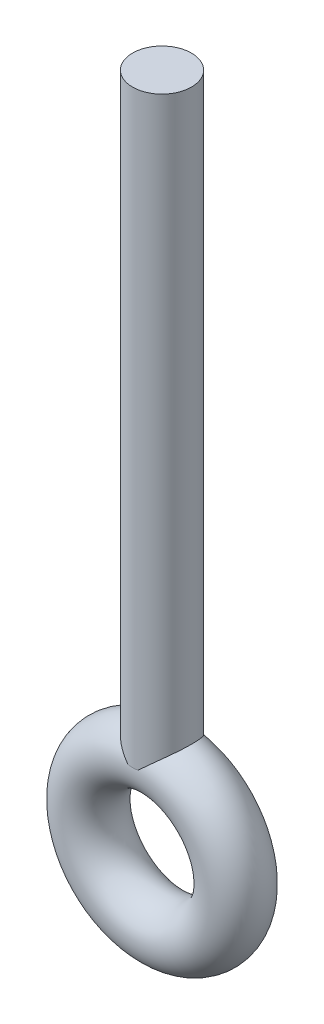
ISO-10303-21;
HEADER;
FILE_DESCRIPTION(('STEP AP214'),'2;1');
FILE_NAME('part.step','',(''),(''),'','','');
FILE_SCHEMA(('AUTOMOTIVE_DESIGN { 1 0 10303 214 1 1 1 1 }'));
ENDSEC;
DATA;
#1=APPLICATION_CONTEXT('core data for automotive mechanical design processes');
#2=APPLICATION_PROTOCOL_DEFINITION('international standard','automotive_design',2000,#1);
#3=PRODUCT_CONTEXT('',#1,'mechanical');
#4=PRODUCT('Part','Part','',(#3));
#5=PRODUCT_RELATED_PRODUCT_CATEGORY('part','',(#4));
#6=PRODUCT_DEFINITION_FORMATION('','',#4);
#7=PRODUCT_DEFINITION_CONTEXT('part definition',#1,'design');
#8=PRODUCT_DEFINITION('design','',#6,#7);
#9=PRODUCT_DEFINITION_SHAPE('','',#8);
#10=(LENGTH_UNIT() NAMED_UNIT(*) SI_UNIT(.MILLI.,.METRE.));
#11=(NAMED_UNIT(*) PLANE_ANGLE_UNIT() SI_UNIT($,.RADIAN.));
#12=(NAMED_UNIT(*) SI_UNIT($,.STERADIAN.) SOLID_ANGLE_UNIT());
#13=UNCERTAINTY_MEASURE_WITH_UNIT(LENGTH_MEASURE(1.E-05),#10,'distance_accuracy_value','');
#14=(GEOMETRIC_REPRESENTATION_CONTEXT(3) GLOBAL_UNCERTAINTY_ASSIGNED_CONTEXT((#13)) GLOBAL_UNIT_ASSIGNED_CONTEXT((#10,
#11,#12)) REPRESENTATION_CONTEXT('',''));
#15=CARTESIAN_POINT('',(0.,0.,0.));
#16=DIRECTION('',(0.,0.,1.));
#17=DIRECTION('',(1.,0.,0.));
#18=AXIS2_PLACEMENT_3D('',#15,#16,#17);
#19=CARTESIAN_POINT('',(0.,8.,0.));
#20=DIRECTION('',(0.,1.,0.));
#21=DIRECTION('',(0.,0.,1.));
#22=AXIS2_PLACEMENT_3D('',#19,#20,#21);
#23=PLANE('',#22);
#24=CARTESIAN_POINT('',(0.,8.,2.95803989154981));
#25=CARTESIAN_POINT('',(-0.247460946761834,8.,2.95804711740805));
#26=CARTESIAN_POINT('',(-0.49492265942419,8.,2.95616386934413));
#27=CARTESIAN_POINT('',(-0.989773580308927,8.,2.94788561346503));
#28=CARTESIAN_POINT('',(-1.23716279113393,8.,2.94149079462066));
#29=CARTESIAN_POINT('',(-1.60776807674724,8.,2.92679903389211));
#30=CARTESIAN_POINT('',(-1.731082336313,8.,2.92106134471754));
#31=CARTESIAN_POINT('',(-1.97758381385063,8.,2.90746047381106));
#32=CARTESIAN_POINT('',(-2.10077103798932,8.,2.89959740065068));
#33=CARTESIAN_POINT('',(-2.46998876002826,8.,2.87212468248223));
#34=CARTESIAN_POINT('',(-2.71577107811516,8.,2.84862845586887));
#35=CARTESIAN_POINT('',(-3.12136668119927,8.,2.79714191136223));
#36=CARTESIAN_POINT('',(-3.28172002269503,8.,2.77346517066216));
#37=CARTESIAN_POINT('',(-3.60098801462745,8.,2.71792496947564));
#38=CARTESIAN_POINT('',(-3.75990307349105,8.,2.68606391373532));
#39=CARTESIAN_POINT('',(-4.07526568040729,8.,2.61236064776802));
#40=CARTESIAN_POINT('',(-4.23171575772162,8.,2.57052948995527));
#41=CARTESIAN_POINT('',(-4.54085538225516,8.,2.47487456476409));
#42=CARTESIAN_POINT('',(-4.69354717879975,8.,2.42105817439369));
#43=CARTESIAN_POINT('',(-5.02114932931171,8.,2.28793160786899));
#44=CARTESIAN_POINT('',(-5.19492044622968,8.,2.20574311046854));
#45=CARTESIAN_POINT('',(-5.52939647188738,8.,2.01780762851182));
#46=CARTESIAN_POINT('',(-5.69011477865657,8.,1.91208522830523));
#47=CARTESIAN_POINT('',(-5.95753271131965,8.,1.70059309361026));
#48=CARTESIAN_POINT('',(-6.06831082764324,8.,1.60002476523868));
#49=CARTESIAN_POINT('',(-6.27238605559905,8.,1.38240612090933));
#50=CARTESIAN_POINT('',(-6.36570690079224,8.,1.26537856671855));
#51=CARTESIAN_POINT('',(-6.51329983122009,8.,1.04010634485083));
#52=CARTESIAN_POINT('',(-6.57163288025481,8.,0.934533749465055));
#53=CARTESIAN_POINT('',(-6.67002120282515,8.,0.715134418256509));
#54=CARTESIAN_POINT('',(-6.71008623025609,8.,0.601312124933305));
#55=CARTESIAN_POINT('',(-6.7694642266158,8.,0.367665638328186));
#56=CARTESIAN_POINT('',(-6.78866633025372,8.,0.247812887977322));
#57=CARTESIAN_POINT('',(-6.80446971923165,8.,0.00662180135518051));
#58=CARTESIAN_POINT('',(-6.80107644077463,8.,-0.114716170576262));
#59=CARTESIAN_POINT('',(-6.77326925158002,8.,-0.344084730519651));
#60=CARTESIAN_POINT('',(-6.75072472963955,8.,-0.452349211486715));
#61=CARTESIAN_POINT('',(-6.68849017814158,8.,-0.663777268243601));
#62=CARTESIAN_POINT('',(-6.64880041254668,8.,-0.766940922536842));
#63=CARTESIAN_POINT('',(-6.55241367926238,8.,-0.970289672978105));
#64=CARTESIAN_POINT('',(-6.49506970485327,8.,-1.07016536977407));
#65=CARTESIAN_POINT('',(-6.36682471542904,8.,-1.26077000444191));
#66=CARTESIAN_POINT('',(-6.29591319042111,8.,-1.35149176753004));
#67=CARTESIAN_POINT('',(-6.10249444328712,8.,-1.5689667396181));
#68=CARTESIAN_POINT('',(-5.97262185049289,8.,-1.68917707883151));
#69=CARTESIAN_POINT('',(-5.69547750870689,8.,-1.90730054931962));
#70=CARTESIAN_POINT('',(-5.54817808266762,8.,-2.00517746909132));
#71=CARTESIAN_POINT('',(-5.27463351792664,8.,-2.16223273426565));
#72=CARTESIAN_POINT('',(-5.1505221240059,8.,-2.22521772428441));
#73=CARTESIAN_POINT('',(-4.89720959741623,8.,-2.34010688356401));
#74=CARTESIAN_POINT('',(-4.76800491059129,8.,-2.39200314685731));
#75=CARTESIAN_POINT('',(-4.50575508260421,8.,-2.48618961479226));
#76=CARTESIAN_POINT('',(-4.37269965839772,8.,-2.52845077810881));
#77=CARTESIAN_POINT('',(-4.10430734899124,8.,-2.60450190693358));
#78=CARTESIAN_POINT('',(-3.96897180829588,8.,-2.6382966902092));
#79=CARTESIAN_POINT('',(-3.60023653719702,8.,-2.72014870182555));
#80=CARTESIAN_POINT('',(-3.36532021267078,8.,-2.76133707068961));
#81=CARTESIAN_POINT('',(-2.89325855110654,8.,-2.82842060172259));
#82=CARTESIAN_POINT('',(-2.65611139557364,8.,-2.85430194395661));
#83=CARTESIAN_POINT('',(-2.18011166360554,8.,-2.89539352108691));
#84=CARTESIAN_POINT('',(-1.94125602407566,8.,-2.91056627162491));
#85=CARTESIAN_POINT('',(-1.46330724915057,8.,-2.93368425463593));
#86=CARTESIAN_POINT('',(-1.22421421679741,8.,-2.94163184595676));
#87=CARTESIAN_POINT('',(-0.743847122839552,8.,-2.9527968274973));
#88=CARTESIAN_POINT('',(-0.502572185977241,8.,-2.95597245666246));
#89=CARTESIAN_POINT('',(-0.0199792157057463,8.,-2.95865902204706));
#90=CARTESIAN_POINT('',(0.221338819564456,8.,-2.95816957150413));
#91=CARTESIAN_POINT('',(0.70344713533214,8.,-2.95333444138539));
#92=CARTESIAN_POINT('',(0.944237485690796,8.,-2.94899665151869));
#93=CARTESIAN_POINT('',(1.42564383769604,8.,-2.93491469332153));
#94=CARTESIAN_POINT('',(1.66625985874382,8.,-2.92517126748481));
#95=CARTESIAN_POINT('',(2.14569930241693,8.,-2.89752531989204));
#96=CARTESIAN_POINT('',(2.38452518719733,8.,-2.8796690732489));
#97=CARTESIAN_POINT('',(2.86124761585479,8.,-2.83187784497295));
#98=CARTESIAN_POINT('',(3.09914322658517,8.,-2.80193287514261));
#99=CARTESIAN_POINT('',(3.56967012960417,8.,-2.72542663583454));
#100=CARTESIAN_POINT('',(3.8023305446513,8.,-2.67905220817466));
#101=CARTESIAN_POINT('',(4.26192487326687,8.,-2.56393752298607));
#102=CARTESIAN_POINT('',(4.48886813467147,8.,-2.49523672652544));
#103=CARTESIAN_POINT('',(4.86544771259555,8.,-2.35392675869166));
#104=CARTESIAN_POINT('',(5.01782302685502,8.,-2.2886947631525));
#105=CARTESIAN_POINT('',(5.31488130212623,8.,-2.14151619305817));
#106=CARTESIAN_POINT('',(5.45954577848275,8.,-2.05953154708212));
#107=CARTESIAN_POINT('',(5.73784718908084,8.,-1.8759752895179));
#108=CARTESIAN_POINT('',(5.87138064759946,8.,-1.77424407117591));
#109=CARTESIAN_POINT('',(6.11992064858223,8.,-1.55023382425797));
#110=CARTESIAN_POINT('',(6.23496748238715,8.,-1.42800070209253));
#111=CARTESIAN_POINT('',(6.41264946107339,8.,-1.19761963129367));
#112=CARTESIAN_POINT('',(6.4811444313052,8.,-1.09400485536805));
#113=CARTESIAN_POINT('',(6.60039535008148,8.,-0.87693884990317));
#114=CARTESIAN_POINT('',(6.65115958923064,8.,-0.76349224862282));
#115=CARTESIAN_POINT('',(6.73197157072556,8.,-0.528491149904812));
#116=CARTESIAN_POINT('',(6.76187746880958,8.,-0.406887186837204));
#117=CARTESIAN_POINT('',(6.79808596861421,8.,-0.160207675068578));
#118=CARTESIAN_POINT('',(6.80440053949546,8.,-0.0351339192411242));
#119=CARTESIAN_POINT('',(6.79356008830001,8.,0.200775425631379));
#120=CARTESIAN_POINT('',(6.77879605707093,8.,0.311729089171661));
#121=CARTESIAN_POINT('',(6.73097486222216,8.,0.529580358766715));
#122=CARTESIAN_POINT('',(6.69791817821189,8.,0.636478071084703));
#123=CARTESIAN_POINT('',(6.6150792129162,8.,0.844632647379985));
#124=CARTESIAN_POINT('',(6.56514823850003,8.,0.945829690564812));
#125=CARTESIAN_POINT('',(6.45116096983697,8.,1.13988097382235));
#126=CARTESIAN_POINT('',(6.38709704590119,8.,1.23273066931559));
#127=CARTESIAN_POINT('',(6.21446603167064,8.,1.45085834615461));
#128=CARTESIAN_POINT('',(6.09915290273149,8.,1.57080194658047));
#129=CARTESIAN_POINT('',(5.85077918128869,8.,1.79061235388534));
#130=CARTESIAN_POINT('',(5.71768391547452,8.,1.89043895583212));
#131=CARTESIAN_POINT('',(5.47280767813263,8.,2.04974334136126));
#132=CARTESIAN_POINT('',(5.36353175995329,8.,2.11316288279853));
#133=CARTESIAN_POINT('',(5.13979135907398,8.,2.23018643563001));
#134=CARTESIAN_POINT('',(5.02532374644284,8.,2.28378442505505));
#135=CARTESIAN_POINT('',(4.79250469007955,8.,2.38222673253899));
#136=CARTESIAN_POINT('',(4.67414714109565,8.,2.42705643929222));
#137=CARTESIAN_POINT('',(4.43483223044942,8.,2.50888202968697));
#138=CARTESIAN_POINT('',(4.31387580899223,8.,2.54588069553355));
#139=CARTESIAN_POINT('',(4.02321226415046,8.,2.62599579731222));
#140=CARTESIAN_POINT('',(3.8526491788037,8.,2.66599136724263));
#141=CARTESIAN_POINT('',(3.50934978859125,8.,2.73539836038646));
#142=CARTESIAN_POINT('',(3.33661230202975,8.,2.76480374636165));
#143=CARTESIAN_POINT('',(2.98953899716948,8.,2.81524361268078));
#144=CARTESIAN_POINT('',(2.81520039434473,8.,2.83625844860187));
#145=CARTESIAN_POINT('',(2.46591102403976,8.,2.8717230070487));
#146=CARTESIAN_POINT('',(2.29096036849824,8.,2.88617387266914));
#147=CARTESIAN_POINT('',(1.93972593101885,8.,2.91019183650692));
#148=CARTESIAN_POINT('',(1.76344027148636,8.,2.91973034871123));
#149=CARTESIAN_POINT('',(1.41071151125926,8.,2.93510926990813));
#150=CARTESIAN_POINT('',(1.23426840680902,8.,2.94094958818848));
#151=CARTESIAN_POINT('',(0.881533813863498,8.,2.94989268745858));
#152=CARTESIAN_POINT('',(0.705242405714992,8.,2.9529988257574));
#153=CARTESIAN_POINT('',(0.352634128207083,8.,2.95706986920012));
#154=CARTESIAN_POINT('',(0.176317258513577,8.,2.95803474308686));
#155=CARTESIAN_POINT('',(0.,8.,2.95803989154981));
#156=B_SPLINE_CURVE_WITH_KNOTS('',3,(#24,#25,#26,#27,#28,#29,#30,#31,#32,#33,#34,#35,#36,#37,
#38,#39,#40,#41,#42,#43,#44,#45,#46,#47,#48,#49,#50,#51,#52,#53,#54,#55,#56,#57,#58,#59,#60,#61,
#62,#63,#64,#65,#66,#67,#68,#69,#70,#71,#72,#73,#74,#75,#76,#77,#78,#79,#80,#81,#82,#83,#84,#85,
#86,#87,#88,#89,#90,#91,#92,#93,#94,#95,#96,#97,#98,#99,#100,#101,#102,#103,#104,#105,#106,#107,
#108,#109,#110,#111,#112,#113,#114,#115,#116,#117,#118,#119,#120,#121,#122,#123,#124,#125,#126,
#127,#128,#129,#130,#131,#132,#133,#134,#135,#136,#137,#138,#139,#140,#141,#142,#143,#144,#145,
#146,#147,#148,#149,#150,#151,#152,#153,#154,#155),.UNSPECIFIED.,.T.,.F.,(4,2,2,2,2,2,2,2,2,2,2,
2,2,2,2,2,2,2,2,2,2,2,2,2,2,2,2,2,2,2,2,2,2,2,2,2,2,2,2,2,2,2,2,2,2,2,2,2,2,2,2,2,2,2,2,2,2,2,2,
2,2,2,2,2,2,4),(0.,0.742377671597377,1.48472424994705,1.85504950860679,2.22535585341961,
2.96568123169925,3.45179511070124,3.93776632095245,4.42320129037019,4.90833829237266,
5.48356135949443,6.05818632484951,6.50548354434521,6.95216816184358,7.31254439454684,
7.67272798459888,8.03481636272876,8.39681762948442,8.72707505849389,9.05732740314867,
9.40151600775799,9.7459723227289,10.2738794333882,10.8026365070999,11.2195910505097,
11.6368418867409,12.0553342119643,12.4735878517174,13.1882955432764,13.9036475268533,
14.621491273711,15.3391005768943,16.0629540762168,16.7868839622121,17.5093330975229,
18.2316830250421,18.9499634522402,19.668838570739,20.3797877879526,21.0894872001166,
21.5859374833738,22.0835287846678,22.5853233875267,23.0860090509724,23.457203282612,
23.8282237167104,24.2017432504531,24.5750732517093,24.9092659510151,25.2434498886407,
25.5806588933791,25.9180503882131,26.4144159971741,26.911763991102,27.2902853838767,
27.6690380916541,28.0484166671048,28.427660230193,28.9527782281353,29.4781951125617,
30.0048350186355,30.5313831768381,31.0609617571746,31.590553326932,32.1194936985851,
32.6484417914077),.UNSPECIFIED.);
#157=CARTESIAN_POINT('',(-0.516666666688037,8.,-2.95517436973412));
#158=VERTEX_POINT('',#157);
#159=CARTESIAN_POINT('',(0.516666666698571,8.,-2.95517436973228));
#160=VERTEX_POINT('',#159);
#161=EDGE_CURVE('E11',#158,#160,#156,.T.);
#162=ORIENTED_EDGE('',*,*,#161,.F.);
#163=CARTESIAN_POINT('',(0.,8.,0.));
#164=DIRECTION('',(0.,1.,0.));
#165=DIRECTION('',(0.,0.,1.));
#166=AXIS2_PLACEMENT_3D('',#163,#164,#165);
#167=CIRCLE('',#166,3.);
#168=EDGE_CURVE('E74',#160,#158,#167,.T.);
#169=ORIENTED_EDGE('',*,*,#168,.F.);
#170=EDGE_LOOP('',(#162,#169));
#171=FACE_BOUND('',#170,.T.);
#172=ADVANCED_FACE('F33',(#171),#23,.F.);
#173=CARTESIAN_POINT('',(0.,68.,0.));
#174=DIRECTION('',(0.,-1.,0.));
#175=DIRECTION('',(0.,0.,-1.));
#176=AXIS2_PLACEMENT_3D('',#173,#174,#175);
#177=CYLINDRICAL_SURFACE('',#176,3.);
#178=CARTESIAN_POINT('',(0.516453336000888,7.99980000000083,-2.95521165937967));
#179=CARTESIAN_POINT('',(0.608004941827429,8.08563367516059,-2.93919241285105));
#180=CARTESIAN_POINT('',(0.699806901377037,8.17031465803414,-2.9187792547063));
#181=CARTESIAN_POINT('',(0.883410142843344,8.33715369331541,-2.86857108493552));
#182=CARTESIAN_POINT('',(0.975211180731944,8.41930741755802,-2.83876086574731));
#183=CARTESIAN_POINT('',(1.25073421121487,8.66240561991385,-2.73393456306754));
#184=CARTESIAN_POINT('',(1.43322654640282,8.81872902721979,-2.64373825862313));
#185=CARTESIAN_POINT('',(1.74150824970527,9.07661492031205,-2.44779812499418));
#186=CARTESIAN_POINT('',(1.87008404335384,9.182108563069,-2.3515495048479));
#187=CARTESIAN_POINT('',(2.11493421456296,9.37996427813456,-2.13394159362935));
#188=CARTESIAN_POINT('',(2.23125118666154,9.47237223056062,-2.01267389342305));
#189=CARTESIAN_POINT('',(2.42810748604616,9.62686718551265,-1.76769344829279));
#190=CARTESIAN_POINT('',(2.51137936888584,9.69144089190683,-1.64774749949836));
#191=CARTESIAN_POINT('',(2.66170556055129,9.80708592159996,-1.391856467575));
#192=CARTESIAN_POINT('',(2.72875620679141,9.85815419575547,-1.25590778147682));
#193=CARTESIAN_POINT('',(2.81431400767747,9.92296224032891,-1.04193621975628));
#194=CARTESIAN_POINT('',(2.84040225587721,9.94265263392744,-0.968631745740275));
#195=CARTESIAN_POINT('',(2.88701602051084,9.97775269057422,-0.819294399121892));
#196=CARTESIAN_POINT('',(2.9075442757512,9.99316446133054,-0.743262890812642));
#197=CARTESIAN_POINT('',(2.94265275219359,10.0194793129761,-0.589101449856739));
#198=CARTESIAN_POINT('',(2.95723530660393,10.0303841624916,-0.510972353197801));
#199=CARTESIAN_POINT('',(2.98018674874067,10.047530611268,-0.353330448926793));
#200=CARTESIAN_POINT('',(2.98855643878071,10.0537728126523,-0.27381782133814));
#201=CARTESIAN_POINT('',(3.00281617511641,10.0644082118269,-0.0534249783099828));
#202=CARTESIAN_POINT('',(3.00200186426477,10.0638014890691,0.0882248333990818));
#203=CARTESIAN_POINT('',(2.98054788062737,10.0477994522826,0.369048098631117));
#204=CARTESIAN_POINT('',(2.95991277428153,10.0324075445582,0.508222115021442));
#205=CARTESIAN_POINT('',(2.90117169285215,9.98839501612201,0.775410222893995));
#206=CARTESIAN_POINT('',(2.86369771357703,9.96025265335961,0.903644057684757));
#207=CARTESIAN_POINT('',(2.77346075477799,9.89207099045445,1.15121467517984));
#208=CARTESIAN_POINT('',(2.72069432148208,9.85202900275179,1.27054944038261));
#209=CARTESIAN_POINT('',(2.59768610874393,9.75795375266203,1.50702626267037));
#210=CARTESIAN_POINT('',(2.52641246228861,9.70308130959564,1.62329388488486));
#211=CARTESIAN_POINT('',(2.37199445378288,9.58298120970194,1.84161732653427));
#212=CARTESIAN_POINT('',(2.28884672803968,9.51775061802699,1.94366910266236));
#213=CARTESIAN_POINT('',(2.07723516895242,9.34976800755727,2.17217363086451));
#214=CARTESIAN_POINT('',(1.94425264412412,9.2426560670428,2.2912601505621));
#215=CARTESIAN_POINT('',(1.66693276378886,9.01482356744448,2.50033047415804));
#216=CARTESIAN_POINT('',(1.52255777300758,8.89405727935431,2.59021233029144));
#217=CARTESIAN_POINT('',(1.23438379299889,8.64755832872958,2.73888870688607));
#218=CARTESIAN_POINT('',(1.09080455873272,8.52223318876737,2.7988081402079));
#219=CARTESIAN_POINT('',(0.803303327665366,8.26535847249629,2.89437704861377));
#220=CARTESIAN_POINT('',(0.659393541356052,8.13386757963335,2.9302193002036));
#221=CARTESIAN_POINT('',(0.516453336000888,7.99980000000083,2.95521165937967));
#222=B_SPLINE_CURVE_WITH_KNOTS('',3,(#178,#179,#180,#181,#182,#183,#184,#185,#186,#187,#188,
#189,#190,#191,#192,#193,#194,#195,#196,#197,#198,#199,#200,#201,#202,#203,#204,#205,#206,#207,
#208,#209,#210,#211,#212,#213,#214,#215,#216,#217,#218,#219,#220,#221),.UNSPECIFIED.,.F.,.F.,(4,
2,2,2,2,2,2,2,2,2,2,2,2,2,2,2,2,2,2,2,2,4),(0.,0.379343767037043,0.759304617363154,
1.52473936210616,2.09918095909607,2.67155578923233,3.14865851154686,3.62586885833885,
3.86635774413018,4.10672795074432,4.34700374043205,4.58724849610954,5.0098499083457,
5.43235398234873,5.84017682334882,6.24809184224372,6.68737783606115,7.12678851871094,
7.74794672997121,8.37125055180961,8.96896149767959,9.5618278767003),.UNSPECIFIED.);
#223=CARTESIAN_POINT('',(0.516666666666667,8.,2.95517436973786));
#224=VERTEX_POINT('',#223);
#225=EDGE_CURVE('E38',#160,#224,#222,.T.);
#226=ORIENTED_EDGE('',*,*,#225,.F.);
#227=ORIENTED_EDGE('',*,*,#168,.T.);
#228=CARTESIAN_POINT('',(-0.516453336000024,7.99980000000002,2.95521165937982));
#229=CARTESIAN_POINT('',(-0.608004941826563,8.08563367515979,2.93919241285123));
#230=CARTESIAN_POINT('',(-0.699806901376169,8.17031465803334,2.91877925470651));
#231=CARTESIAN_POINT('',(-0.883410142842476,8.33715369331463,2.86857108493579));
#232=CARTESIAN_POINT('',(-0.975211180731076,8.41930741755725,2.83876086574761));
#233=CARTESIAN_POINT('',(-1.25073421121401,8.66240561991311,2.73393456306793));
#234=CARTESIAN_POINT('',(-1.43322654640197,8.81872902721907,2.64373825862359));
#235=CARTESIAN_POINT('',(-1.74150824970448,9.07661492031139,2.44779812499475));
#236=CARTESIAN_POINT('',(-1.8700840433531,9.18210856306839,2.35154950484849));
#237=CARTESIAN_POINT('',(-2.11493421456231,9.37996427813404,2.13394159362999));
#238=CARTESIAN_POINT('',(-2.23125118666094,9.47237223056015,2.01267389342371));
#239=CARTESIAN_POINT('',(-2.42810748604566,9.62686718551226,1.76769344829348));
#240=CARTESIAN_POINT('',(-2.51137936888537,9.69144089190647,1.64774749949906));
#241=CARTESIAN_POINT('',(-2.66170556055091,9.80708592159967,1.39185646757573));
#242=CARTESIAN_POINT('',(-2.72875620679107,9.85815419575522,1.25590778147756));
#243=CARTESIAN_POINT('',(-2.8143140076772,9.9229622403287,1.04193621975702));
#244=CARTESIAN_POINT('',(-2.84040225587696,9.94265263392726,0.968631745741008));
#245=CARTESIAN_POINT('',(-2.88701602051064,9.97775269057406,0.81929439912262));
#246=CARTESIAN_POINT('',(-2.90754427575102,9.99316446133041,0.743262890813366));
#247=CARTESIAN_POINT('',(-2.94265275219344,10.019479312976,0.589101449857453));
#248=CARTESIAN_POINT('',(-2.95723530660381,10.0303841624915,0.510972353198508));
#249=CARTESIAN_POINT('',(-2.98018674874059,10.047530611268,0.353330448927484));
#250=CARTESIAN_POINT('',(-2.98855643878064,10.0537728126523,0.273817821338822));
#251=CARTESIAN_POINT('',(-3.0028161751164,10.0644082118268,0.0534249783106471));
#252=CARTESIAN_POINT('',(-3.00200186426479,10.0638014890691,-0.0882248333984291));
#253=CARTESIAN_POINT('',(-2.98054788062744,10.0477994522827,-0.369048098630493));
#254=CARTESIAN_POINT('',(-2.95991277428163,10.0324075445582,-0.508222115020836));
#255=CARTESIAN_POINT('',(-2.90117169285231,9.98839501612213,-0.775410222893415));
#256=CARTESIAN_POINT('',(-2.86369771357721,9.96025265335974,-0.903644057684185));
#257=CARTESIAN_POINT('',(-2.77346075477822,9.89207099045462,-1.15121467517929));
#258=CARTESIAN_POINT('',(-2.72069432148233,9.85202900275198,-1.27054944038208));
#259=CARTESIAN_POINT('',(-2.59768610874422,9.75795375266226,-1.50702626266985));
#260=CARTESIAN_POINT('',(-2.52641246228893,9.70308130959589,-1.62329388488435));
#261=CARTESIAN_POINT('',(-2.37199445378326,9.58298120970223,-1.84161732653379));
#262=CARTESIAN_POINT('',(-2.28884672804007,9.5177506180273,-1.94366910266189));
#263=CARTESIAN_POINT('',(-2.07723516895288,9.34976800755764,-2.17217363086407));
#264=CARTESIAN_POINT('',(-1.94425264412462,9.2426560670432,-2.29126015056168));
#265=CARTESIAN_POINT('',(-1.66693276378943,9.01482356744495,-2.50033047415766));
#266=CARTESIAN_POINT('',(-1.52255777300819,8.89405727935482,-2.59021233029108));
#267=CARTESIAN_POINT('',(-1.23438379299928,8.64755832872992,-2.73888870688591));
#268=CARTESIAN_POINT('',(-1.09080455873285,8.5222331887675,-2.79880814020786));
#269=CARTESIAN_POINT('',(-0.803303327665,8.26535847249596,-2.89437704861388));
#270=CARTESIAN_POINT('',(-0.659393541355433,8.13386757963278,-2.93021930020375));
#271=CARTESIAN_POINT('',(-0.516453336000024,7.99980000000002,-2.95521165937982));
#272=B_SPLINE_CURVE_WITH_KNOTS('',3,(#228,#229,#230,#231,#232,#233,#234,#235,#236,#237,#238,
#239,#240,#241,#242,#243,#244,#245,#246,#247,#248,#249,#250,#251,#252,#253,#254,#255,#256,#257,
#258,#259,#260,#261,#262,#263,#264,#265,#266,#267,#268,#269,#270,#271),.UNSPECIFIED.,.F.,.F.,(4,
2,2,2,2,2,2,2,2,2,2,2,2,2,2,2,2,2,2,2,2,4),(0.,0.379343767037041,0.759304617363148,
1.52473936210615,2.09918095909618,2.67155578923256,3.14865851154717,3.62586885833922,
3.86635774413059,4.10672795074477,4.34700374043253,4.58724849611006,5.00984990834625,
5.43235398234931,5.8401768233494,6.24809184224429,6.68737783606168,7.12678851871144,
7.74794672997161,8.37125055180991,8.96896149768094,9.56182787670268),.UNSPECIFIED.);
#273=CARTESIAN_POINT('',(-0.516666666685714,8.,2.95517436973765));
#274=VERTEX_POINT('',#273);
#275=EDGE_CURVE('E69',#274,#158,#272,.T.);
#276=ORIENTED_EDGE('',*,*,#275,.F.);
#277=EDGE_CURVE('E53',#274,#224,#167,.T.);
#278=ORIENTED_EDGE('',*,*,#277,.T.);
#279=EDGE_LOOP('',(#226,#227,#276,#278));
#280=FACE_BOUND('',#279,.T.);
#281=CARTESIAN_POINT('',(0.,68.,0.));
#282=DIRECTION('',(0.,1.,0.));
#283=DIRECTION('',(0.,0.,1.));
#284=AXIS2_PLACEMENT_3D('',#281,#282,#283);
#285=CIRCLE('',#284,3.);
#286=CARTESIAN_POINT('',(0.,68.,3.));
#287=VERTEX_POINT('',#286);
#288=EDGE_CURVE('E70',#287,#287,#285,.T.);
#289=ORIENTED_EDGE('',*,*,#288,.F.);
#290=EDGE_LOOP('',(#289));
#291=FACE_BOUND('',#290,.T.);
#292=ADVANCED_FACE('F72',(#280,#291),#177,.T.);
#293=CARTESIAN_POINT('',(0.,68.,0.));
#294=DIRECTION('',(0.,1.,0.));
#295=DIRECTION('',(0.,0.,1.));
#296=AXIS2_PLACEMENT_3D('',#293,#294,#295);
#297=PLANE('',#296);
#298=ORIENTED_EDGE('',*,*,#288,.T.);
#299=EDGE_LOOP('',(#298));
#300=FACE_BOUND('',#299,.T.);
#301=ADVANCED_FACE('F84',(#300),#297,.T.);
#302=EDGE_CURVE('E47',#224,#274,#156,.T.);
#303=ORIENTED_EDGE('',*,*,#302,.F.);
#304=ORIENTED_EDGE('',*,*,#277,.F.);
#305=EDGE_LOOP('',(#303,#304));
#306=FACE_BOUND('',#305,.T.);
#307=ADVANCED_FACE('F65',(#306),#23,.F.);
#308=CARTESIAN_POINT('',(0.,0.,0.));
#309=DIRECTION('',(0.,0.,-1.));
#310=DIRECTION('',(-1.,0.,0.));
#311=AXIS2_PLACEMENT_3D('',#308,#309,#310);
#312=TOROIDAL_SURFACE('',#311,7.5,3.);
#313=ORIENTED_EDGE('',*,*,#275,.T.);
#314=ORIENTED_EDGE('',*,*,#161,.T.);
#315=ORIENTED_EDGE('',*,*,#225,.T.);
#316=ORIENTED_EDGE('',*,*,#302,.T.);
#317=EDGE_LOOP('',(#313,#314,#315,#316));
#318=FACE_BOUND('',#317,.T.);
#319=ADVANCED_FACE('F35',(#318),#312,.T.);
#320=CLOSED_SHELL('',(#172,#292,#301,#307,#319));
#321=MANIFOLD_SOLID_BREP('B2',#320);
#322=ADVANCED_BREP_SHAPE_REPRESENTATION('',(#18,#321),#14);
#323=SHAPE_DEFINITION_REPRESENTATION(#9,#322);
ENDSEC;
END-ISO-10303-21;
